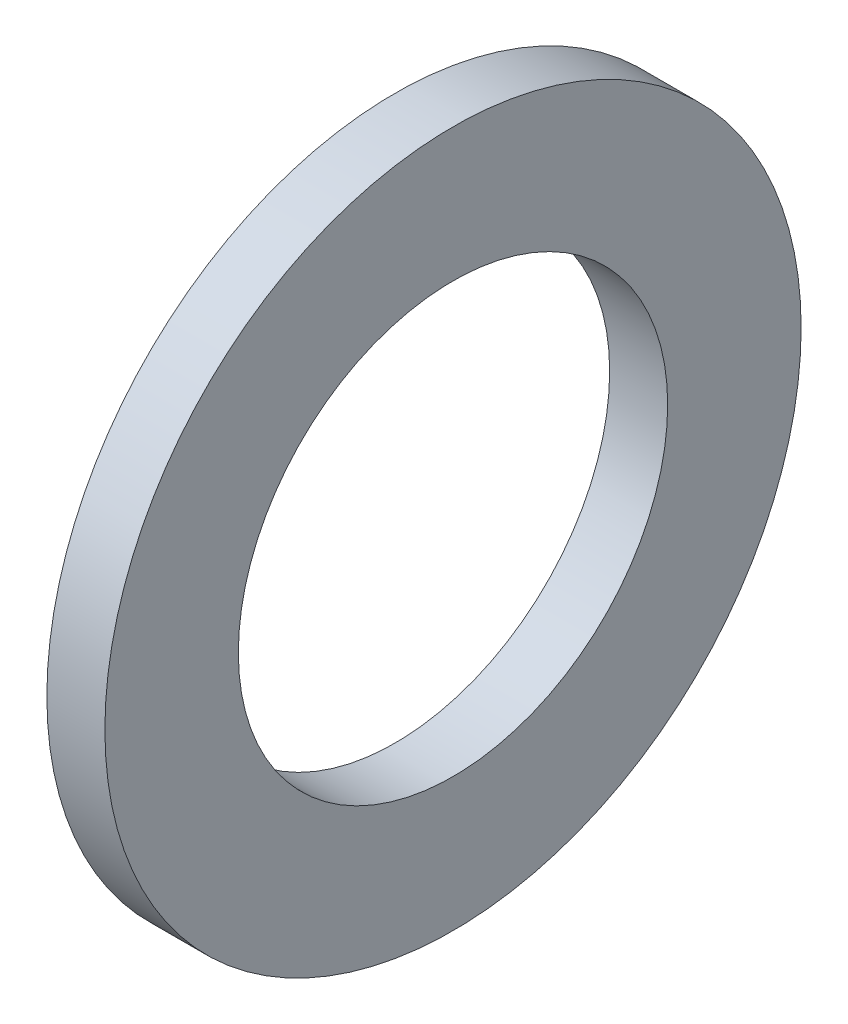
from build123d import *

# Parameters (mm, degrees)
SKETCH1_W = 5
SKETCH1_H = 11.5


with BuildPart() as part:
    # Sketch1 → Base-Revolve (revolve)
    with BuildSketch(Plane.XY, mode=Mode.PRIVATE) as base_revolve_sk:
        with Locations((-2.5, 24.25)):
            Rectangle(SKETCH1_W, SKETCH1_H)
    revolve(base_revolve_sk.sketch.rotate(Axis((-34.925, 0, 0), (1, 0, 0)), 90), axis=Axis((-34.925, 0, 0), (1, 0, 0)))


solid = part.part
